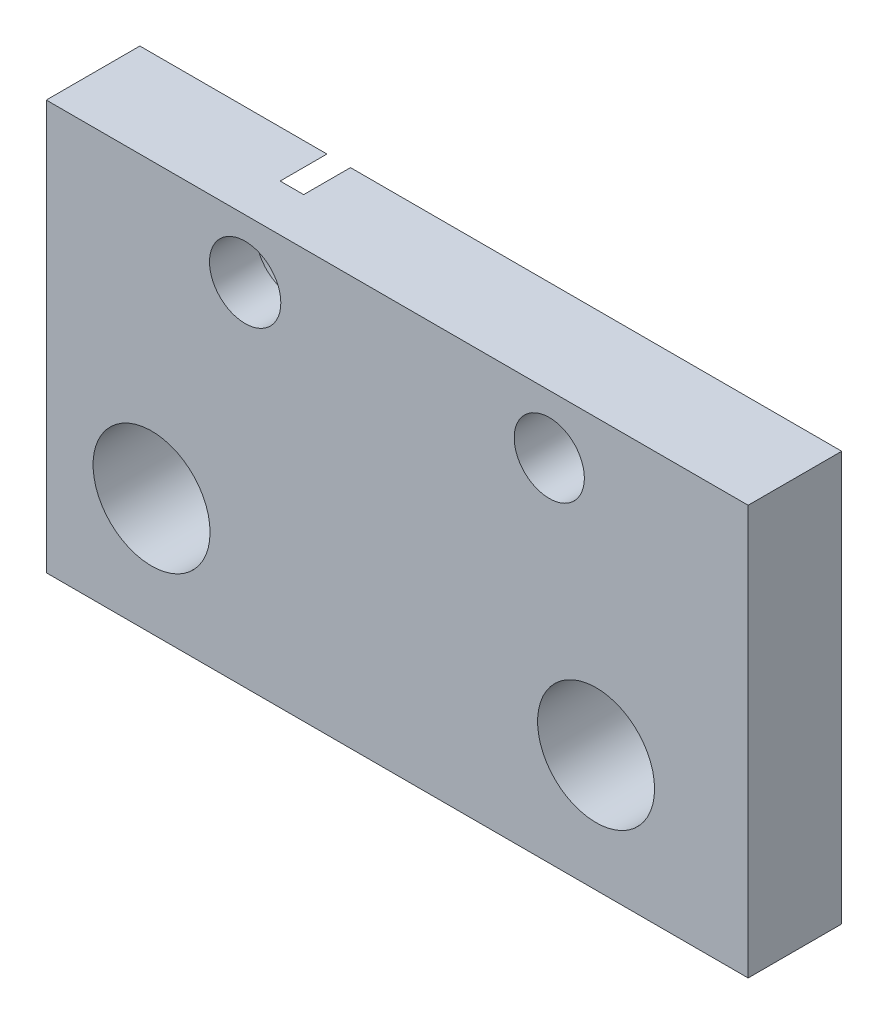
ISO-10303-21;
HEADER;
FILE_DESCRIPTION(('STEP AP214'),'2;1');
FILE_NAME('part.step','',(''),(''),'','','');
FILE_SCHEMA(('AUTOMOTIVE_DESIGN { 1 0 10303 214 1 1 1 1 }'));
ENDSEC;
DATA;
#1=APPLICATION_CONTEXT('core data for automotive mechanical design processes');
#2=APPLICATION_PROTOCOL_DEFINITION('international standard','automotive_design',2000,#1);
#3=PRODUCT_CONTEXT('',#1,'mechanical');
#4=PRODUCT('Part','Part','',(#3));
#5=PRODUCT_RELATED_PRODUCT_CATEGORY('part','',(#4));
#6=PRODUCT_DEFINITION_FORMATION('','',#4);
#7=PRODUCT_DEFINITION_CONTEXT('part definition',#1,'design');
#8=PRODUCT_DEFINITION('design','',#6,#7);
#9=PRODUCT_DEFINITION_SHAPE('','',#8);
#10=(LENGTH_UNIT() NAMED_UNIT(*) SI_UNIT(.MILLI.,.METRE.));
#11=(NAMED_UNIT(*) PLANE_ANGLE_UNIT() SI_UNIT($,.RADIAN.));
#12=(NAMED_UNIT(*) SI_UNIT($,.STERADIAN.) SOLID_ANGLE_UNIT());
#13=UNCERTAINTY_MEASURE_WITH_UNIT(LENGTH_MEASURE(1.E-05),#10,'distance_accuracy_value','');
#14=(GEOMETRIC_REPRESENTATION_CONTEXT(3) GLOBAL_UNCERTAINTY_ASSIGNED_CONTEXT((#13)) GLOBAL_UNIT_ASSIGNED_CONTEXT((#10,
#11,#12)) REPRESENTATION_CONTEXT('',''));
#15=CARTESIAN_POINT('',(0.,0.,0.));
#16=DIRECTION('',(0.,0.,1.));
#17=DIRECTION('',(1.,0.,0.));
#18=AXIS2_PLACEMENT_3D('',#15,#16,#17);
#19=CARTESIAN_POINT('',(-13.,20.,0.));
#20=DIRECTION('',(0.,0.,1.));
#21=DIRECTION('',(1.,0.,0.));
#22=AXIS2_PLACEMENT_3D('',#19,#20,#21);
#23=CYLINDRICAL_SURFACE('',#22,3.05);
#24=CARTESIAN_POINT('',(-13.,20.,8.));
#25=DIRECTION('',(0.,0.,1.));
#26=DIRECTION('',(1.,0.,0.));
#27=AXIS2_PLACEMENT_3D('',#24,#25,#26);
#28=CIRCLE('',#27,3.05);
#29=CARTESIAN_POINT('',(-9.95,20.,8.));
#30=VERTEX_POINT('',#29);
#31=EDGE_CURVE('E108',#30,#30,#28,.T.);
#32=ORIENTED_EDGE('',*,*,#31,.T.);
#33=EDGE_LOOP('',(#32));
#34=FACE_BOUND('',#33,.T.);
#35=CARTESIAN_POINT('',(-13.,20.,4.));
#36=DIRECTION('',(0.,0.,-1.));
#37=DIRECTION('',(-1.,0.,0.));
#38=AXIS2_PLACEMENT_3D('',#35,#36,#37);
#39=CIRCLE('',#38,3.05);
#40=CARTESIAN_POINT('',(-16.05,20.,4.));
#41=VERTEX_POINT('',#40);
#42=EDGE_CURVE('E35',#41,#41,#39,.F.);
#43=ORIENTED_EDGE('',*,*,#42,.F.);
#44=EDGE_LOOP('',(#43));
#45=FACE_BOUND('',#44,.T.);
#46=ADVANCED_FACE('F31',(#34,#45),#23,.F.);
#47=CARTESIAN_POINT('',(-30.,-10.,8.));
#48=DIRECTION('',(-1.,0.,0.));
#49=DIRECTION('',(0.,0.,1.));
#50=AXIS2_PLACEMENT_3D('',#47,#48,#49);
#51=PLANE('',#50);
#52=DIRECTION('',(0.,0.,-1.));
#53=VECTOR('',#52,1.);
#54=CARTESIAN_POINT('',(-30.,-10.,8.));
#55=LINE('',#54,#53);
#56=CARTESIAN_POINT('',(-30.,-10.,8.));
#57=VERTEX_POINT('',#56);
#58=CARTESIAN_POINT('',(-30.,-10.,0.));
#59=VERTEX_POINT('',#58);
#60=EDGE_CURVE('E11',#57,#59,#55,.T.);
#61=ORIENTED_EDGE('',*,*,#60,.F.);
#62=DIRECTION('',(0.,1.,0.));
#63=VECTOR('',#62,1.);
#64=CARTESIAN_POINT('',(-30.,-10.,8.));
#65=LINE('',#64,#63);
#66=CARTESIAN_POINT('',(-30.,25.,8.));
#67=VERTEX_POINT('',#66);
#68=EDGE_CURVE('E117',#57,#67,#65,.T.);
#69=ORIENTED_EDGE('',*,*,#68,.T.);
#70=DIRECTION('',(0.,0.,-1.));
#71=VECTOR('',#70,1.);
#72=CARTESIAN_POINT('',(-30.,25.,8.));
#73=LINE('',#72,#71);
#74=CARTESIAN_POINT('',(-30.,25.,0.));
#75=VERTEX_POINT('',#74);
#76=EDGE_CURVE('E128',#67,#75,#73,.T.);
#77=ORIENTED_EDGE('',*,*,#76,.T.);
#78=DIRECTION('',(0.,1.,0.));
#79=VECTOR('',#78,1.);
#80=CARTESIAN_POINT('',(-30.,-10.,0.));
#81=LINE('',#80,#79);
#82=EDGE_CURVE('E104',#59,#75,#81,.T.);
#83=ORIENTED_EDGE('',*,*,#82,.F.);
#84=EDGE_LOOP('',(#61,#69,#77,#83));
#85=FACE_BOUND('',#84,.T.);
#86=ADVANCED_FACE('F138',(#85),#51,.T.);
#87=CARTESIAN_POINT('',(-30.,-10.,8.));
#88=DIRECTION('',(0.,1.,0.));
#89=DIRECTION('',(0.,0.,1.));
#90=AXIS2_PLACEMENT_3D('',#87,#88,#89);
#91=PLANE('',#90);
#92=DIRECTION('',(0.,0.,-1.));
#93=VECTOR('',#92,1.);
#94=CARTESIAN_POINT('',(30.,-10.,8.));
#95=LINE('',#94,#93);
#96=CARTESIAN_POINT('',(30.,-10.,8.));
#97=VERTEX_POINT('',#96);
#98=CARTESIAN_POINT('',(30.,-10.,0.));
#99=VERTEX_POINT('',#98);
#100=EDGE_CURVE('E40',#97,#99,#95,.T.);
#101=ORIENTED_EDGE('',*,*,#100,.F.);
#102=DIRECTION('',(1.,0.,0.));
#103=VECTOR('',#102,1.);
#104=CARTESIAN_POINT('',(-30.,-10.,8.));
#105=LINE('',#104,#103);
#106=EDGE_CURVE('E125',#57,#97,#105,.T.);
#107=ORIENTED_EDGE('',*,*,#106,.F.);
#108=ORIENTED_EDGE('',*,*,#60,.T.);
#109=DIRECTION('',(1.,0.,0.));
#110=VECTOR('',#109,1.);
#111=CARTESIAN_POINT('',(-30.,-10.,0.));
#112=LINE('',#111,#110);
#113=EDGE_CURVE('E114',#59,#99,#112,.T.);
#114=ORIENTED_EDGE('',*,*,#113,.T.);
#115=EDGE_LOOP('',(#101,#107,#108,#114));
#116=FACE_BOUND('',#115,.T.);
#117=ADVANCED_FACE('F33',(#116),#91,.F.);
#118=CARTESIAN_POINT('',(30.,25.,8.));
#119=DIRECTION('',(1.,0.,0.));
#120=DIRECTION('',(0.,0.,-1.));
#121=AXIS2_PLACEMENT_3D('',#118,#119,#120);
#122=PLANE('',#121);
#123=DIRECTION('',(0.,0.,-1.));
#124=VECTOR('',#123,1.);
#125=CARTESIAN_POINT('',(30.,25.,8.));
#126=LINE('',#125,#124);
#127=CARTESIAN_POINT('',(30.,25.,8.));
#128=VERTEX_POINT('',#127);
#129=CARTESIAN_POINT('',(30.,25.,0.));
#130=VERTEX_POINT('',#129);
#131=EDGE_CURVE('E130',#128,#130,#126,.T.);
#132=ORIENTED_EDGE('',*,*,#131,.F.);
#133=DIRECTION('',(0.,-1.,0.));
#134=VECTOR('',#133,1.);
#135=CARTESIAN_POINT('',(30.,25.,8.));
#136=LINE('',#135,#134);
#137=EDGE_CURVE('E122',#128,#97,#136,.T.);
#138=ORIENTED_EDGE('',*,*,#137,.T.);
#139=ORIENTED_EDGE('',*,*,#100,.T.);
#140=DIRECTION('',(0.,-1.,0.));
#141=VECTOR('',#140,1.);
#142=CARTESIAN_POINT('',(30.,25.,0.));
#143=LINE('',#142,#141);
#144=EDGE_CURVE('E107',#130,#99,#143,.T.);
#145=ORIENTED_EDGE('',*,*,#144,.F.);
#146=EDGE_LOOP('',(#132,#138,#139,#145));
#147=FACE_BOUND('',#146,.T.);
#148=ADVANCED_FACE('F134',(#147),#122,.T.);
#149=CARTESIAN_POINT('',(30.,25.,8.));
#150=DIRECTION('',(0.,-1.,0.));
#151=DIRECTION('',(0.,0.,-1.));
#152=AXIS2_PLACEMENT_3D('',#149,#150,#151);
#153=PLANE('',#152);
#154=DIRECTION('',(1.,0.,0.));
#155=VECTOR('',#154,1.);
#156=CARTESIAN_POINT('',(30.,25.,4.));
#157=LINE('',#156,#155);
#158=CARTESIAN_POINT('',(-14.0049875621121,25.,4.));
#159=VERTEX_POINT('',#158);
#160=CARTESIAN_POINT('',(-11.9950124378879,25.,4.));
#161=VERTEX_POINT('',#160);
#162=EDGE_CURVE('E98',#159,#161,#157,.T.);
#163=ORIENTED_EDGE('',*,*,#162,.F.);
#164=DIRECTION('',(0.,0.,-1.));
#165=VECTOR('',#164,1.);
#166=CARTESIAN_POINT('',(-14.0049875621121,25.,4.));
#167=LINE('',#166,#165);
#168=CARTESIAN_POINT('',(-14.0049875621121,25.,0.));
#169=VERTEX_POINT('',#168);
#170=EDGE_CURVE('E85',#159,#169,#167,.T.);
#171=ORIENTED_EDGE('',*,*,#170,.T.);
#172=DIRECTION('',(-1.,0.,0.));
#173=VECTOR('',#172,1.);
#174=CARTESIAN_POINT('',(30.,25.,0.));
#175=LINE('',#174,#173);
#176=EDGE_CURVE('E96',#169,#75,#175,.T.);
#177=ORIENTED_EDGE('',*,*,#176,.T.);
#178=ORIENTED_EDGE('',*,*,#76,.F.);
#179=DIRECTION('',(-1.,0.,0.));
#180=VECTOR('',#179,1.);
#181=CARTESIAN_POINT('',(30.,25.,8.));
#182=LINE('',#181,#180);
#183=EDGE_CURVE('E119',#128,#67,#182,.T.);
#184=ORIENTED_EDGE('',*,*,#183,.F.);
#185=ORIENTED_EDGE('',*,*,#131,.T.);
#186=CARTESIAN_POINT('',(-11.9950124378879,25.,0.));
#187=VERTEX_POINT('',#186);
#188=EDGE_CURVE('E105',#130,#187,#175,.T.);
#189=ORIENTED_EDGE('',*,*,#188,.T.);
#190=DIRECTION('',(0.,0.,-1.));
#191=VECTOR('',#190,1.);
#192=CARTESIAN_POINT('',(-11.9950124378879,25.,4.));
#193=LINE('',#192,#191);
#194=EDGE_CURVE('E47',#187,#161,#193,.F.);
#195=ORIENTED_EDGE('',*,*,#194,.T.);
#196=EDGE_LOOP('',(#163,#171,#177,#178,#184,#185,#189,#195));
#197=FACE_BOUND('',#196,.T.);
#198=ADVANCED_FACE('F95',(#197),#153,.F.);
#199=CARTESIAN_POINT('',(-30.,25.,8.));
#200=DIRECTION('',(0.,0.,1.));
#201=DIRECTION('',(1.,0.,0.));
#202=AXIS2_PLACEMENT_3D('',#199,#200,#201);
#203=PLANE('',#202);
#204=CARTESIAN_POINT('',(17.,0.,8.));
#205=DIRECTION('',(0.,0.,1.));
#206=DIRECTION('',(1.,0.,0.));
#207=AXIS2_PLACEMENT_3D('',#204,#205,#206);
#208=CIRCLE('',#207,5.);
#209=CARTESIAN_POINT('',(22.,0.,8.));
#210=VERTEX_POINT('',#209);
#211=EDGE_CURVE('E99',#210,#210,#208,.T.);
#212=ORIENTED_EDGE('',*,*,#211,.F.);
#213=EDGE_LOOP('',(#212));
#214=FACE_BOUND('',#213,.T.);
#215=CARTESIAN_POINT('',(-21.,0.,8.));
#216=DIRECTION('',(0.,0.,1.));
#217=DIRECTION('',(1.,0.,0.));
#218=AXIS2_PLACEMENT_3D('',#215,#216,#217);
#219=CIRCLE('',#218,5.);
#220=CARTESIAN_POINT('',(-16.,0.,8.));
#221=VERTEX_POINT('',#220);
#222=EDGE_CURVE('E196',#221,#221,#219,.T.);
#223=ORIENTED_EDGE('',*,*,#222,.F.);
#224=EDGE_LOOP('',(#223));
#225=FACE_BOUND('',#224,.T.);
#226=CARTESIAN_POINT('',(13.,20.,8.));
#227=DIRECTION('',(0.,0.,1.));
#228=DIRECTION('',(1.,0.,0.));
#229=AXIS2_PLACEMENT_3D('',#226,#227,#228);
#230=CIRCLE('',#229,3.);
#231=CARTESIAN_POINT('',(16.,20.,8.));
#232=VERTEX_POINT('',#231);
#233=EDGE_CURVE('E202',#232,#232,#230,.T.);
#234=ORIENTED_EDGE('',*,*,#233,.F.);
#235=EDGE_LOOP('',(#234));
#236=FACE_BOUND('',#235,.T.);
#237=ORIENTED_EDGE('',*,*,#31,.F.);
#238=EDGE_LOOP('',(#237));
#239=FACE_BOUND('',#238,.T.);
#240=ORIENTED_EDGE('',*,*,#68,.F.);
#241=ORIENTED_EDGE('',*,*,#106,.T.);
#242=ORIENTED_EDGE('',*,*,#137,.F.);
#243=ORIENTED_EDGE('',*,*,#183,.T.);
#244=EDGE_LOOP('',(#240,#241,#242,#243));
#245=FACE_BOUND('',#244,.T.);
#246=ADVANCED_FACE('F141',(#214,#225,#236,#239,#245),#203,.T.);
#247=CARTESIAN_POINT('',(-30.,25.,0.));
#248=DIRECTION('',(0.,0.,1.));
#249=DIRECTION('',(1.,0.,0.));
#250=AXIS2_PLACEMENT_3D('',#247,#248,#249);
#251=PLANE('',#250);
#252=CARTESIAN_POINT('',(17.,0.,0.));
#253=DIRECTION('',(0.,0.,1.));
#254=DIRECTION('',(1.,0.,0.));
#255=AXIS2_PLACEMENT_3D('',#252,#253,#254);
#256=CIRCLE('',#255,5.);
#257=CARTESIAN_POINT('',(22.,0.,0.));
#258=VERTEX_POINT('',#257);
#259=EDGE_CURVE('E193',#258,#258,#256,.T.);
#260=ORIENTED_EDGE('',*,*,#259,.T.);
#261=EDGE_LOOP('',(#260));
#262=FACE_BOUND('',#261,.T.);
#263=CARTESIAN_POINT('',(-21.,0.,0.));
#264=DIRECTION('',(0.,0.,1.));
#265=DIRECTION('',(1.,0.,0.));
#266=AXIS2_PLACEMENT_3D('',#263,#264,#265);
#267=CIRCLE('',#266,5.);
#268=CARTESIAN_POINT('',(-16.,0.,0.));
#269=VERTEX_POINT('',#268);
#270=EDGE_CURVE('E199',#269,#269,#267,.T.);
#271=ORIENTED_EDGE('',*,*,#270,.T.);
#272=EDGE_LOOP('',(#271));
#273=FACE_BOUND('',#272,.T.);
#274=CARTESIAN_POINT('',(13.,20.,0.));
#275=DIRECTION('',(0.,0.,1.));
#276=DIRECTION('',(1.,0.,0.));
#277=AXIS2_PLACEMENT_3D('',#274,#275,#276);
#278=CIRCLE('',#277,3.);
#279=CARTESIAN_POINT('',(16.,20.,0.));
#280=VERTEX_POINT('',#279);
#281=EDGE_CURVE('E205',#280,#280,#278,.T.);
#282=ORIENTED_EDGE('',*,*,#281,.T.);
#283=EDGE_LOOP('',(#282));
#284=FACE_BOUND('',#283,.T.);
#285=ORIENTED_EDGE('',*,*,#176,.F.);
#286=CARTESIAN_POINT('',(-13.,20.,0.));
#287=DIRECTION('',(0.,0.,-1.));
#288=DIRECTION('',(-1.,0.,0.));
#289=AXIS2_PLACEMENT_3D('',#286,#287,#288);
#290=CIRCLE('',#289,5.1);
#291=EDGE_CURVE('E82',#187,#169,#290,.T.);
#292=ORIENTED_EDGE('',*,*,#291,.F.);
#293=ORIENTED_EDGE('',*,*,#188,.F.);
#294=ORIENTED_EDGE('',*,*,#144,.T.);
#295=ORIENTED_EDGE('',*,*,#113,.F.);
#296=ORIENTED_EDGE('',*,*,#82,.T.);
#297=EDGE_LOOP('',(#285,#292,#293,#294,#295,#296));
#298=FACE_BOUND('',#297,.T.);
#299=ADVANCED_FACE('F102',(#262,#273,#284,#298),#251,.F.);
#300=CARTESIAN_POINT('',(13.,20.,0.));
#301=DIRECTION('',(0.,0.,1.));
#302=DIRECTION('',(1.,0.,0.));
#303=AXIS2_PLACEMENT_3D('',#300,#301,#302);
#304=CYLINDRICAL_SURFACE('',#303,3.);
#305=ORIENTED_EDGE('',*,*,#281,.F.);
#306=EDGE_LOOP('',(#305));
#307=FACE_BOUND('',#306,.T.);
#308=ORIENTED_EDGE('',*,*,#233,.T.);
#309=EDGE_LOOP('',(#308));
#310=FACE_BOUND('',#309,.T.);
#311=ADVANCED_FACE('F149',(#307,#310),#304,.F.);
#312=CARTESIAN_POINT('',(-21.,0.,0.));
#313=DIRECTION('',(0.,0.,1.));
#314=DIRECTION('',(1.,0.,0.));
#315=AXIS2_PLACEMENT_3D('',#312,#313,#314);
#316=CYLINDRICAL_SURFACE('',#315,5.);
#317=ORIENTED_EDGE('',*,*,#270,.F.);
#318=EDGE_LOOP('',(#317));
#319=FACE_BOUND('',#318,.T.);
#320=ORIENTED_EDGE('',*,*,#222,.T.);
#321=EDGE_LOOP('',(#320));
#322=FACE_BOUND('',#321,.T.);
#323=ADVANCED_FACE('F168',(#319,#322),#316,.F.);
#324=CARTESIAN_POINT('',(17.,0.,0.));
#325=DIRECTION('',(0.,0.,1.));
#326=DIRECTION('',(1.,0.,0.));
#327=AXIS2_PLACEMENT_3D('',#324,#325,#326);
#328=CYLINDRICAL_SURFACE('',#327,5.);
#329=ORIENTED_EDGE('',*,*,#259,.F.);
#330=EDGE_LOOP('',(#329));
#331=FACE_BOUND('',#330,.T.);
#332=ORIENTED_EDGE('',*,*,#211,.T.);
#333=EDGE_LOOP('',(#332));
#334=FACE_BOUND('',#333,.T.);
#335=ADVANCED_FACE('F172',(#331,#334),#328,.F.);
#336=CARTESIAN_POINT('',(-13.,20.,4.));
#337=DIRECTION('',(0.,0.,-1.));
#338=DIRECTION('',(-1.,0.,0.));
#339=AXIS2_PLACEMENT_3D('',#336,#337,#338);
#340=CYLINDRICAL_SURFACE('',#339,5.1);
#341=CARTESIAN_POINT('',(-13.,20.,4.));
#342=DIRECTION('',(0.,0.,-1.));
#343=DIRECTION('',(-1.,0.,0.));
#344=AXIS2_PLACEMENT_3D('',#341,#342,#343);
#345=CIRCLE('',#344,5.1);
#346=EDGE_CURVE('E91',#161,#159,#345,.T.);
#347=ORIENTED_EDGE('',*,*,#346,.F.);
#348=ORIENTED_EDGE('',*,*,#194,.F.);
#349=ORIENTED_EDGE('',*,*,#291,.T.);
#350=ORIENTED_EDGE('',*,*,#170,.F.);
#351=EDGE_LOOP('',(#347,#348,#349,#350));
#352=FACE_BOUND('',#351,.T.);
#353=ADVANCED_FACE('F84',(#352),#340,.F.);
#354=CARTESIAN_POINT('',(-13.,20.,4.));
#355=DIRECTION('',(0.,0.,-1.));
#356=DIRECTION('',(-1.,0.,0.));
#357=AXIS2_PLACEMENT_3D('',#354,#355,#356);
#358=PLANE('',#357);
#359=ORIENTED_EDGE('',*,*,#42,.T.);
#360=EDGE_LOOP('',(#359));
#361=FACE_BOUND('',#360,.T.);
#362=ORIENTED_EDGE('',*,*,#162,.T.);
#363=ORIENTED_EDGE('',*,*,#346,.T.);
#364=EDGE_LOOP('',(#362,#363));
#365=FACE_BOUND('',#364,.T.);
#366=ADVANCED_FACE('F179',(#361,#365),#358,.T.);
#367=CLOSED_SHELL('',(#46,#86,#117,#148,#198,#246,#299,#311,#323,#335,#353,#366));
#368=MANIFOLD_SOLID_BREP('B2',#367);
#369=ADVANCED_BREP_SHAPE_REPRESENTATION('',(#18,#368),#14);
#370=SHAPE_DEFINITION_REPRESENTATION(#9,#369);
ENDSEC;
END-ISO-10303-21;
